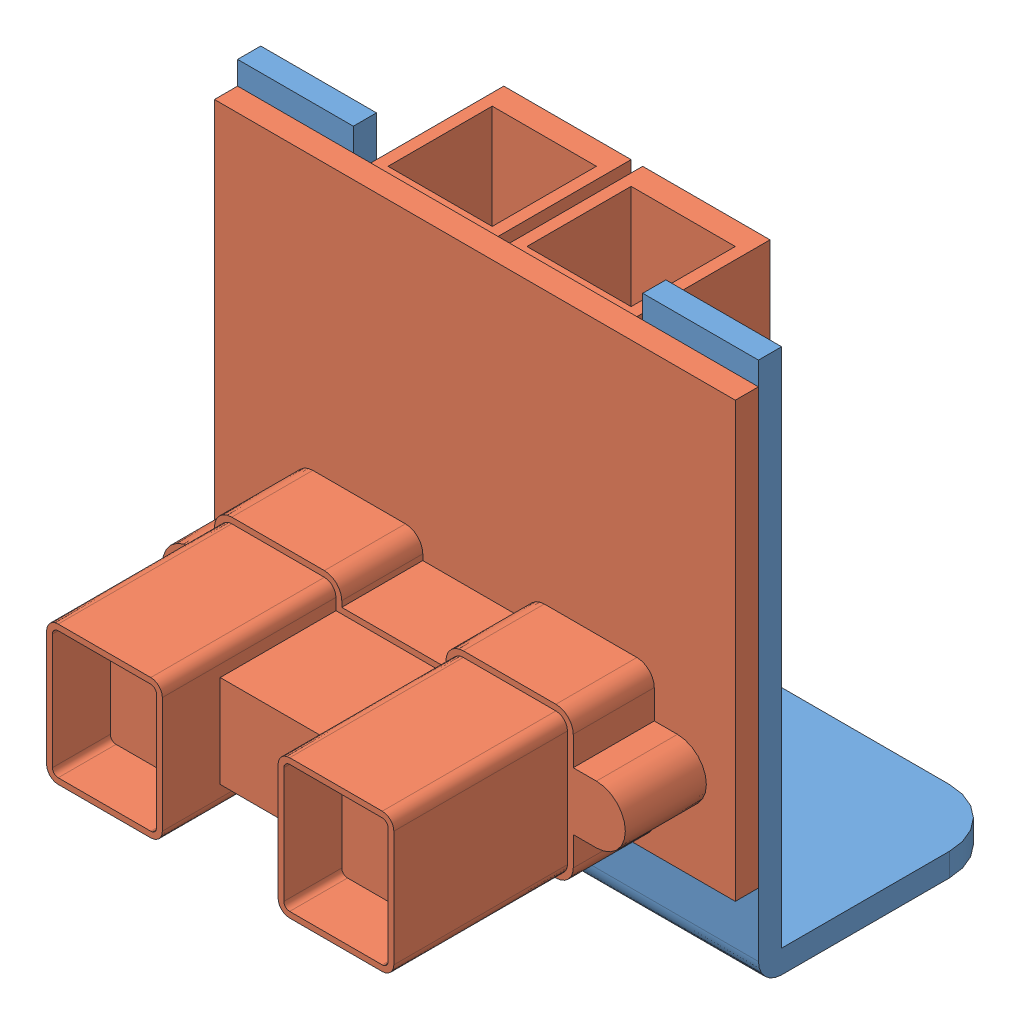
SolidWorks assembly Assem1.sldasm, configuration Default (file format 13000). Lengths in mm.
Overall size (45 47 45.5).
2 component instances, 2 part files, 3 mates.
Components (placement in the parent):
- IR_Mount_Curve-1: IR_Mount_Curve.SLDPRT [Default] at (-5.7768 24.0881 59.4756) size (45 47 21.5)
- IR_LR-1: IR_LR.SLDPRT [Default] at (-5.7768 26.8381 61.4756) size (45 37.5 36)
Mates (geometry in assembly coordinates):
- Coincident1: coincident: plane of IR_Mount_Curve-1 through (-5.7768 24.0881 61.4756) normal (0 0 1); plane of IR_LR-1 through (-5.7768 26.8381 61.4756) normal (0 0 -1)
- Coincident2: coincident: plane of IR_Mount_Curve-1 through (-18.2768 25.0881 39.9756) normal (0 1 0); plane of IR_LR-1 through (-5.2768 25.0881 49.4756) normal (0 -1 0)
- Coincident4: coincident aligned: plane of IR_Mount_Curve-1 through (16.7232 47.5881 61.4756) normal (1 0 0); plane of IR_LR-1 through (16.7232 45.5881 63.4756) normal (1 0 0)
